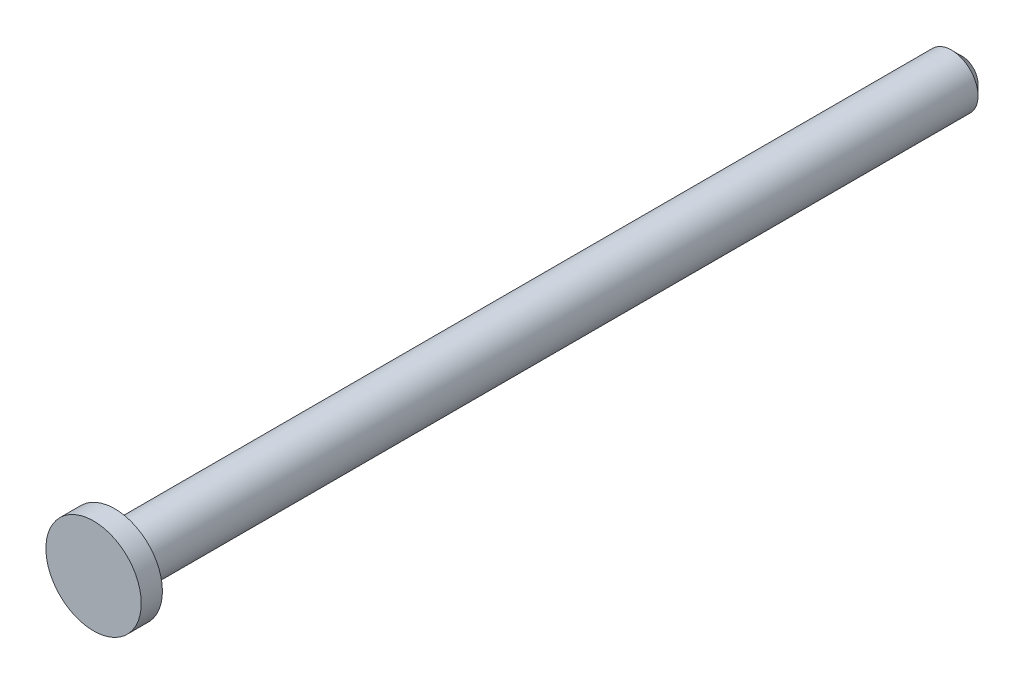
ISO-10303-21;
HEADER;
FILE_DESCRIPTION(('STEP AP214'),'2;1');
FILE_NAME('part.step','',(''),(''),'','','');
FILE_SCHEMA(('AUTOMOTIVE_DESIGN { 1 0 10303 214 1 1 1 1 }'));
ENDSEC;
DATA;
#1=APPLICATION_CONTEXT('core data for automotive mechanical design processes');
#2=APPLICATION_PROTOCOL_DEFINITION('international standard','automotive_design',2000,#1);
#3=PRODUCT_CONTEXT('',#1,'mechanical');
#4=PRODUCT('Part','Part','',(#3));
#5=PRODUCT_RELATED_PRODUCT_CATEGORY('part','',(#4));
#6=PRODUCT_DEFINITION_FORMATION('','',#4);
#7=PRODUCT_DEFINITION_CONTEXT('part definition',#1,'design');
#8=PRODUCT_DEFINITION('design','',#6,#7);
#9=PRODUCT_DEFINITION_SHAPE('','',#8);
#10=(LENGTH_UNIT() NAMED_UNIT(*) SI_UNIT(.MILLI.,.METRE.));
#11=(NAMED_UNIT(*) PLANE_ANGLE_UNIT() SI_UNIT($,.RADIAN.));
#12=(NAMED_UNIT(*) SI_UNIT($,.STERADIAN.) SOLID_ANGLE_UNIT());
#13=UNCERTAINTY_MEASURE_WITH_UNIT(LENGTH_MEASURE(1.E-05),#10,'distance_accuracy_value','');
#14=(GEOMETRIC_REPRESENTATION_CONTEXT(3) GLOBAL_UNCERTAINTY_ASSIGNED_CONTEXT((#13)) GLOBAL_UNIT_ASSIGNED_CONTEXT((#10,
#11,#12)) REPRESENTATION_CONTEXT('',''));
#15=CARTESIAN_POINT('',(0.,0.,0.));
#16=DIRECTION('',(0.,0.,1.));
#17=DIRECTION('',(1.,0.,0.));
#18=AXIS2_PLACEMENT_3D('',#15,#16,#17);
#19=CARTESIAN_POINT('',(0.,0.,50.8));
#20=DIRECTION('',(0.,0.,-1.));
#21=DIRECTION('',(-1.,0.,0.));
#22=AXIS2_PLACEMENT_3D('',#19,#20,#21);
#23=CYLINDRICAL_SURFACE('',#22,3.175);
#24=CARTESIAN_POINT('',(0.,0.,-49.53));
#25=DIRECTION('',(0.,0.,1.));
#26=DIRECTION('',(1.,0.,0.));
#27=AXIS2_PLACEMENT_3D('',#24,#25,#26);
#28=CIRCLE('',#27,3.175);
#29=CARTESIAN_POINT('',(3.175,0.,-49.53));
#30=VERTEX_POINT('',#29);
#31=EDGE_CURVE('E42',#30,#30,#28,.T.);
#32=ORIENTED_EDGE('',*,*,#31,.T.);
#33=EDGE_LOOP('',(#32));
#34=FACE_BOUND('',#33,.T.);
#35=CARTESIAN_POINT('',(0.,0.,50.8));
#36=DIRECTION('',(0.,0.,1.));
#37=DIRECTION('',(1.,0.,0.));
#38=AXIS2_PLACEMENT_3D('',#35,#36,#37);
#39=CIRCLE('',#38,3.175);
#40=CARTESIAN_POINT('',(3.175,0.,50.8));
#41=VERTEX_POINT('',#40);
#42=EDGE_CURVE('E46',#41,#41,#39,.T.);
#43=ORIENTED_EDGE('',*,*,#42,.F.);
#44=EDGE_LOOP('',(#43));
#45=FACE_BOUND('',#44,.T.);
#46=ADVANCED_FACE('F35',(#34,#45),#23,.T.);
#47=CARTESIAN_POINT('',(0.,0.,-50.8));
#48=DIRECTION('',(0.,0.,1.));
#49=DIRECTION('',(1.,0.,0.));
#50=AXIS2_PLACEMENT_3D('',#47,#48,#49);
#51=PLANE('',#50);
#52=CARTESIAN_POINT('',(0.,0.,-50.8));
#53=DIRECTION('',(0.,0.,1.));
#54=DIRECTION('',(1.,0.,0.));
#55=AXIS2_PLACEMENT_3D('',#52,#53,#54);
#56=CIRCLE('',#55,1.90499999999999);
#57=CARTESIAN_POINT('',(1.90499999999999,0.,-50.8));
#58=VERTEX_POINT('',#57);
#59=EDGE_CURVE('E10',#58,#58,#56,.F.);
#60=ORIENTED_EDGE('',*,*,#59,.T.);
#61=EDGE_LOOP('',(#60));
#62=FACE_BOUND('',#61,.T.);
#63=ADVANCED_FACE('F70',(#62),#51,.F.);
#64=CARTESIAN_POINT('',(0.,0.,50.8));
#65=DIRECTION('',(0.,0.,1.));
#66=DIRECTION('',(1.,0.,0.));
#67=AXIS2_PLACEMENT_3D('',#64,#65,#66);
#68=PLANE('',#67);
#69=CARTESIAN_POINT('',(0.,0.,50.8));
#70=DIRECTION('',(0.,0.,1.));
#71=DIRECTION('',(1.,0.,0.));
#72=AXIS2_PLACEMENT_3D('',#69,#70,#71);
#73=CIRCLE('',#72,5.715);
#74=CARTESIAN_POINT('',(5.715,0.,50.8));
#75=VERTEX_POINT('',#74);
#76=EDGE_CURVE('E53',#75,#75,#73,.T.);
#77=ORIENTED_EDGE('',*,*,#76,.F.);
#78=EDGE_LOOP('',(#77));
#79=FACE_BOUND('',#78,.T.);
#80=ORIENTED_EDGE('',*,*,#42,.T.);
#81=EDGE_LOOP('',(#80));
#82=FACE_BOUND('',#81,.T.);
#83=ADVANCED_FACE('F64',(#79,#82),#68,.F.);
#84=CARTESIAN_POINT('',(0.,0.,53.34));
#85=DIRECTION('',(0.,0.,-1.));
#86=DIRECTION('',(-1.,0.,0.));
#87=AXIS2_PLACEMENT_3D('',#84,#85,#86);
#88=CYLINDRICAL_SURFACE('',#87,5.715);
#89=CARTESIAN_POINT('',(0.,0.,53.34));
#90=DIRECTION('',(0.,0.,1.));
#91=DIRECTION('',(1.,0.,0.));
#92=AXIS2_PLACEMENT_3D('',#89,#90,#91);
#93=CIRCLE('',#92,5.715);
#94=CARTESIAN_POINT('',(5.715,0.,53.34));
#95=VERTEX_POINT('',#94);
#96=EDGE_CURVE('E50',#95,#95,#93,.T.);
#97=ORIENTED_EDGE('',*,*,#96,.F.);
#98=EDGE_LOOP('',(#97));
#99=FACE_BOUND('',#98,.T.);
#100=ORIENTED_EDGE('',*,*,#76,.T.);
#101=EDGE_LOOP('',(#100));
#102=FACE_BOUND('',#101,.T.);
#103=ADVANCED_FACE('F61',(#99,#102),#88,.T.);
#104=CARTESIAN_POINT('',(0.,0.,53.34));
#105=DIRECTION('',(0.,0.,1.));
#106=DIRECTION('',(1.,0.,0.));
#107=AXIS2_PLACEMENT_3D('',#104,#105,#106);
#108=PLANE('',#107);
#109=ORIENTED_EDGE('',*,*,#96,.T.);
#110=EDGE_LOOP('',(#109));
#111=FACE_BOUND('',#110,.T.);
#112=ADVANCED_FACE('F59',(#111),#108,.T.);
#113=CARTESIAN_POINT('',(0.,0.,-49.53));
#114=DIRECTION('',(0.,0.,1.));
#115=DIRECTION('',(1.,0.,0.));
#116=AXIS2_PLACEMENT_3D('',#113,#114,#115);
#117=CONICAL_SURFACE('',#116,3.175,0.785398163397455);
#118=ORIENTED_EDGE('',*,*,#59,.F.);
#119=EDGE_LOOP('',(#118));
#120=FACE_BOUND('',#119,.T.);
#121=ORIENTED_EDGE('',*,*,#31,.F.);
#122=EDGE_LOOP('',(#121));
#123=FACE_BOUND('',#122,.T.);
#124=ADVANCED_FACE('F37',(#120,#123),#117,.T.);
#125=CLOSED_SHELL('',(#46,#63,#83,#103,#112,#124));
#126=MANIFOLD_SOLID_BREP('B2',#125);
#127=ADVANCED_BREP_SHAPE_REPRESENTATION('',(#18,#126),#14);
#128=SHAPE_DEFINITION_REPRESENTATION(#9,#127);
ENDSEC;
END-ISO-10303-21;
